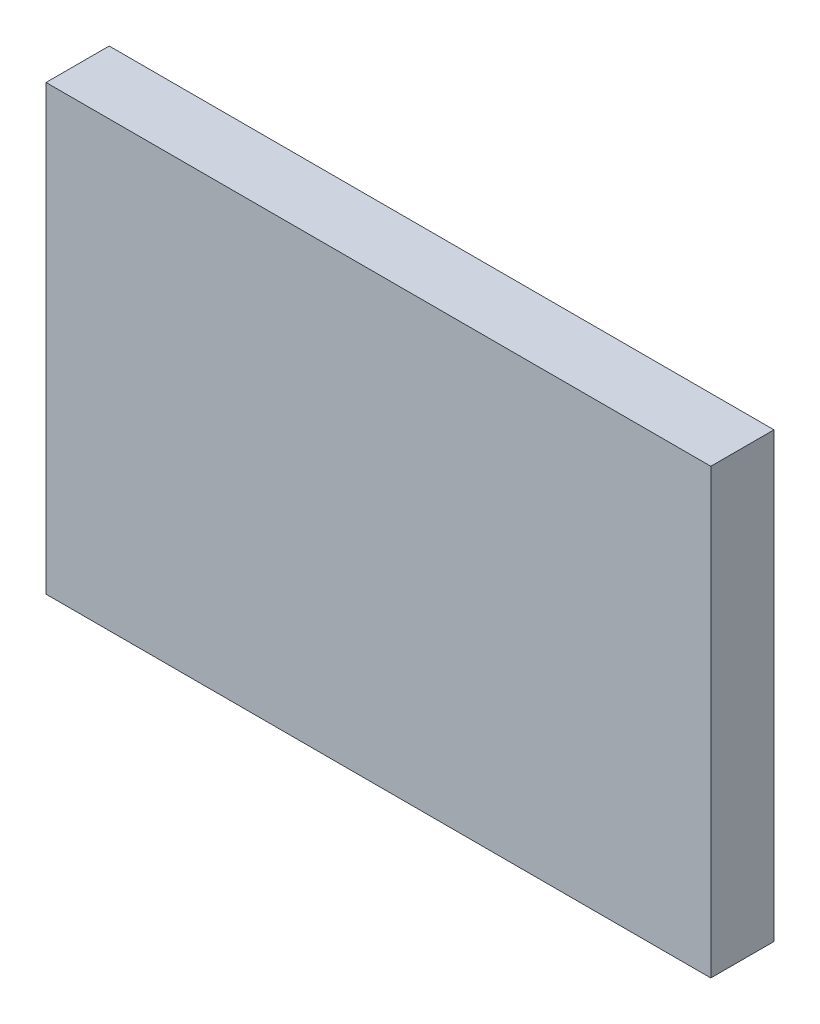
from build123d import *

# Parameters (mm, degrees)
SKETCH3_W           = 60
SKETCH3_H           = 40
BOSS_EXTRUDE1_DEPTH = 5.7


with BuildPart() as part:
    # Sketch3 → Boss-Extrude1 (new body)
    with BuildSketch(Plane.XY):
        with Locations((51.697514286, -7.292422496)):
            Rectangle(SKETCH3_W, SKETCH3_H)
    extrude(amount=BOSS_EXTRUDE1_DEPTH)


solid = part.part
